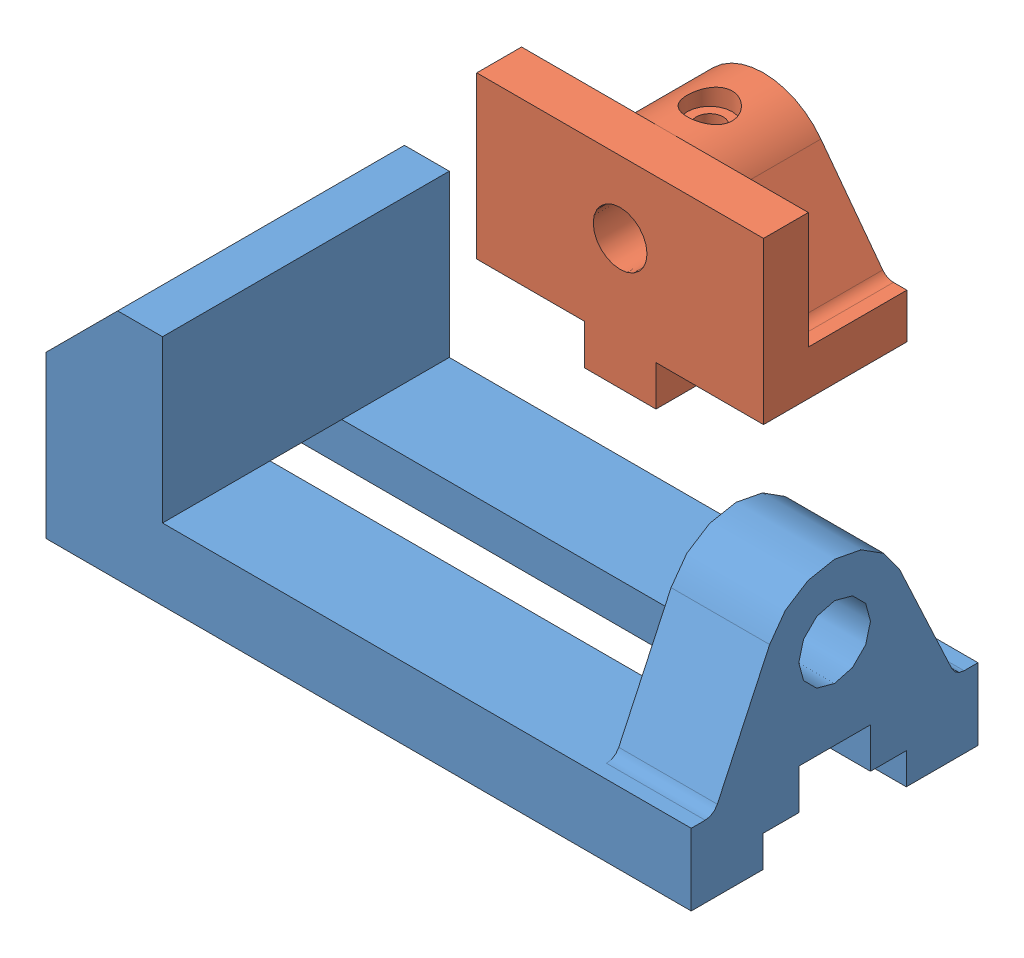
SolidWorks assembly perpendicular mate.SLDASM, configuration Default (file format 6000). Lengths in mm.
Overall size (144 74.07 96).
2 component instances, 2 part files, 1 mates.
Components (placement in the parent):
- vice-body-1: vice-body.SLDPRT [Default] at (-114.7498 -17.2197 16.5933) size (144 52 64)
- vice-jaw-1: vice-jaw.SLDPRT [Default] at (-50.6175 34.8533 -15.4067) x (-1 0 0) z (0 0 -1) size (64 45 32)
Mates (geometry in assembly coordinates):
- Perpendicular2: perpendicular: plane of vice-body-1 through (-88.7498 -1.2197 48.5933) normal (1 0 0); plane of vice-jaw-1 through (-82.6175 11.8533 -15.4067) normal (0 0 1)
